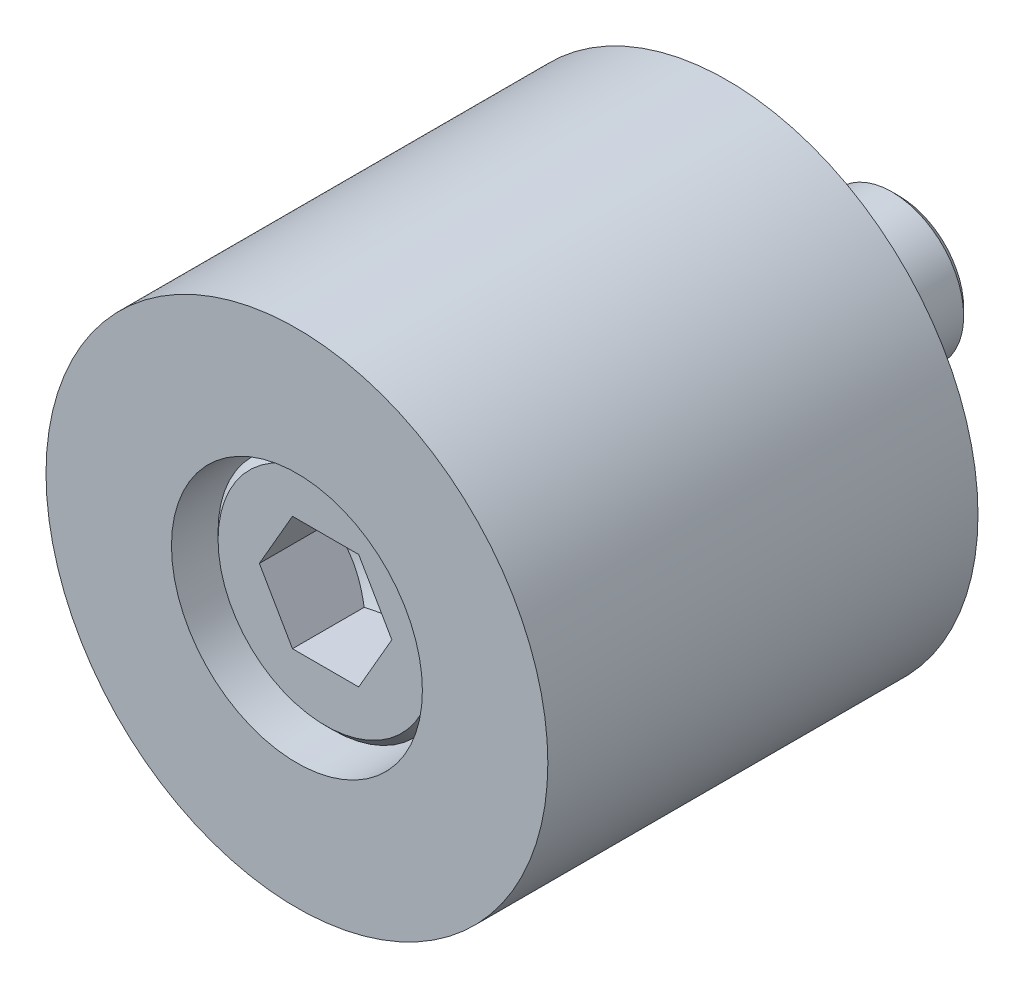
ISO-10303-21;
HEADER;
FILE_DESCRIPTION(('STEP AP214'),'2;1');
FILE_NAME('part.step','',(''),(''),'','','');
FILE_SCHEMA(('AUTOMOTIVE_DESIGN { 1 0 10303 214 1 1 1 1 }'));
ENDSEC;
DATA;
#1=APPLICATION_CONTEXT('core data for automotive mechanical design processes');
#2=APPLICATION_PROTOCOL_DEFINITION('international standard','automotive_design',2000,#1);
#3=PRODUCT_CONTEXT('',#1,'mechanical');
#4=PRODUCT('Part','Part','',(#3));
#5=PRODUCT_RELATED_PRODUCT_CATEGORY('part','',(#4));
#6=PRODUCT_DEFINITION_FORMATION('','',#4);
#7=PRODUCT_DEFINITION_CONTEXT('part definition',#1,'design');
#8=PRODUCT_DEFINITION('design','',#6,#7);
#9=PRODUCT_DEFINITION_SHAPE('','',#8);
#10=(LENGTH_UNIT() NAMED_UNIT(*) SI_UNIT(.MILLI.,.METRE.));
#11=(NAMED_UNIT(*) PLANE_ANGLE_UNIT() SI_UNIT($,.RADIAN.));
#12=(NAMED_UNIT(*) SI_UNIT($,.STERADIAN.) SOLID_ANGLE_UNIT());
#13=UNCERTAINTY_MEASURE_WITH_UNIT(LENGTH_MEASURE(1.E-05),#10,'distance_accuracy_value','');
#14=(GEOMETRIC_REPRESENTATION_CONTEXT(3) GLOBAL_UNCERTAINTY_ASSIGNED_CONTEXT((#13)) GLOBAL_UNIT_ASSIGNED_CONTEXT((#10,
#11,#12)) REPRESENTATION_CONTEXT('',''));
#15=CARTESIAN_POINT('',(0.,0.,0.));
#16=DIRECTION('',(0.,0.,1.));
#17=DIRECTION('',(1.,0.,0.));
#18=AXIS2_PLACEMENT_3D('',#15,#16,#17);
#19=CARTESIAN_POINT('',(0.,0.,15.));
#20=DIRECTION('',(0.,0.,-1.));
#21=DIRECTION('',(1.,0.,0.));
#22=AXIS2_PLACEMENT_3D('',#19,#20,#21);
#23=CYLINDRICAL_SURFACE('',#22,5.25);
#24=CARTESIAN_POINT('',(0.,0.,18.));
#25=DIRECTION('',(0.,0.,1.));
#26=DIRECTION('',(-1.,0.,0.));
#27=AXIS2_PLACEMENT_3D('',#24,#25,#26);
#28=CIRCLE('',#27,5.25);
#29=CARTESIAN_POINT('',(-5.25,0.,18.));
#30=VERTEX_POINT('',#29);
#31=CARTESIAN_POINT('',(5.25,0.,18.));
#32=VERTEX_POINT('',#31);
#33=EDGE_CURVE('P0_E36',#30,#32,#28,.T.);
#34=ORIENTED_EDGE('',*,*,#33,.T.);
#35=CARTESIAN_POINT('',(5.25,0.,17.9999986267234));
#36=CARTESIAN_POINT('',(5.25,0.,-1.84147465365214E-06));
#37=B_SPLINE_CURVE_WITH_KNOTS('',1,(#35,#36),.UNSPECIFIED.,.F.,.F.,(2,2),(0.0833333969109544,
0.916666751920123),.UNSPECIFIED.);
#38=CARTESIAN_POINT('',(5.25,0.,0.));
#39=VERTEX_POINT('',#38);
#40=EDGE_CURVE('P0_E25',#32,#39,#37,.T.);
#41=ORIENTED_EDGE('',*,*,#40,.T.);
#42=CARTESIAN_POINT('',(0.,0.,0.));
#43=DIRECTION('',(0.,0.,1.));
#44=DIRECTION('',(1.,0.,0.));
#45=AXIS2_PLACEMENT_3D('',#42,#43,#44);
#46=CIRCLE('',#45,5.25000000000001);
#47=EDGE_CURVE('P0_E11',#39,#39,#46,.T.);
#48=ORIENTED_EDGE('',*,*,#47,.F.);
#49=ORIENTED_EDGE('',*,*,#40,.F.);
#50=CARTESIAN_POINT('',(0.,0.,18.));
#51=DIRECTION('',(0.,0.,1.));
#52=DIRECTION('',(-1.,0.,0.));
#53=AXIS2_PLACEMENT_3D('',#50,#51,#52);
#54=CIRCLE('',#53,5.25);
#55=EDGE_CURVE('P0_E51',#32,#30,#54,.T.);
#56=ORIENTED_EDGE('',*,*,#55,.T.);
#57=EDGE_LOOP('',(#34,#41,#48,#49,#56));
#58=FACE_BOUND('',#57,.T.);
#59=ADVANCED_FACE('P0_F16',(#58),#23,.F.);
#60=CARTESIAN_POINT('',(0.,0.,24.));
#61=DIRECTION('',(0.,0.,-1.));
#62=DIRECTION('',(1.,0.,0.));
#63=AXIS2_PLACEMENT_3D('',#60,#61,#62);
#64=CYLINDRICAL_SURFACE('',#63,8.75);
#65=CARTESIAN_POINT('',(0.,0.,30.));
#66=DIRECTION('',(0.,0.,-1.));
#67=DIRECTION('',(1.,0.,0.));
#68=AXIS2_PLACEMENT_3D('',#65,#66,#67);
#69=CIRCLE('',#68,8.75);
#70=CARTESIAN_POINT('',(8.75,0.,30.));
#71=VERTEX_POINT('',#70);
#72=EDGE_CURVE('P0_E53',#71,#71,#69,.T.);
#73=ORIENTED_EDGE('',*,*,#72,.F.);
#74=CARTESIAN_POINT('',(8.75,0.,29.9999990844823));
#75=CARTESIAN_POINT('',(8.75,0.,17.9999987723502));
#76=B_SPLINE_CURVE_WITH_KNOTS('',1,(#74,#75),.UNSPECIFIED.,.F.,.F.,(2,2),(0.0833333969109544,
0.916666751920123),.UNSPECIFIED.);
#77=CARTESIAN_POINT('',(8.75,0.,18.));
#78=VERTEX_POINT('',#77);
#79=EDGE_CURVE('P0_E91',#71,#78,#76,.T.);
#80=ORIENTED_EDGE('',*,*,#79,.T.);
#81=CARTESIAN_POINT('',(0.,0.,18.));
#82=DIRECTION('',(0.,0.,-1.));
#83=DIRECTION('',(1.,0.,0.));
#84=AXIS2_PLACEMENT_3D('',#81,#82,#83);
#85=CIRCLE('',#84,8.75);
#86=EDGE_CURVE('P0_E94',#78,#78,#85,.T.);
#87=ORIENTED_EDGE('',*,*,#86,.T.);
#88=ORIENTED_EDGE('',*,*,#79,.F.);
#89=EDGE_LOOP('',(#73,#80,#87,#88));
#90=FACE_BOUND('',#89,.T.);
#91=ADVANCED_FACE('P0_F111',(#90),#64,.F.);
#92=CARTESIAN_POINT('',(-20.125,18.1865334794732,18.));
#93=DIRECTION('',(0.,0.,-1.));
#94=DIRECTION('',(1.,0.,0.));
#95=AXIS2_PLACEMENT_3D('',#92,#93,#94);
#96=PLANE('',#95);
#97=ORIENTED_EDGE('',*,*,#86,.F.);
#98=EDGE_LOOP('',(#97));
#99=FACE_BOUND('',#98,.T.);
#100=ORIENTED_EDGE('',*,*,#55,.F.);
#101=ORIENTED_EDGE('',*,*,#33,.F.);
#102=EDGE_LOOP('',(#100,#101));
#103=FACE_BOUND('',#102,.T.);
#104=ADVANCED_FACE('P0_F55',(#99,#103),#96,.F.);
#105=CARTESIAN_POINT('',(0.,0.,15.));
#106=DIRECTION('',(0.,0.,1.));
#107=DIRECTION('',(1.,0.,0.));
#108=AXIS2_PLACEMENT_3D('',#105,#106,#107);
#109=CYLINDRICAL_SURFACE('',#108,17.5);
#110=CARTESIAN_POINT('',(0.,0.,0.));
#111=DIRECTION('',(0.,0.,-1.));
#112=DIRECTION('',(1.,0.,0.));
#113=AXIS2_PLACEMENT_3D('',#110,#111,#112);
#114=CIRCLE('',#113,17.5);
#115=CARTESIAN_POINT('',(17.5,0.,0.));
#116=VERTEX_POINT('',#115);
#117=EDGE_CURVE('P0_E85',#116,#116,#114,.T.);
#118=ORIENTED_EDGE('',*,*,#117,.F.);
#119=CARTESIAN_POINT('',(17.5,0.,-1.1444331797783E-06));
#120=CARTESIAN_POINT('',(17.5,0.,29.9999996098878));
#121=B_SPLINE_CURVE_WITH_KNOTS('',1,(#119,#120),.UNSPECIFIED.,.F.,.F.,(2,2),(0.0833333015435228,
0.916666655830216),.UNSPECIFIED.);
#122=CARTESIAN_POINT('',(17.5,0.,30.));
#123=VERTEX_POINT('',#122);
#124=EDGE_CURVE('P0_E57',#116,#123,#121,.T.);
#125=ORIENTED_EDGE('',*,*,#124,.T.);
#126=CARTESIAN_POINT('',(0.,0.,30.));
#127=DIRECTION('',(0.,0.,1.));
#128=DIRECTION('',(1.,0.,0.));
#129=AXIS2_PLACEMENT_3D('',#126,#127,#128);
#130=CIRCLE('',#129,17.5);
#131=EDGE_CURVE('P0_E82',#123,#123,#130,.T.);
#132=ORIENTED_EDGE('',*,*,#131,.F.);
#133=ORIENTED_EDGE('',*,*,#124,.F.);
#134=EDGE_LOOP('',(#118,#125,#132,#133));
#135=FACE_BOUND('',#134,.T.);
#136=ADVANCED_FACE('P0_F130',(#135),#109,.T.);
#137=CARTESIAN_POINT('',(22.75,-36.3730669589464,0.));
#138=DIRECTION('',(0.,0.,-1.));
#139=DIRECTION('',(-1.,0.,0.));
#140=AXIS2_PLACEMENT_3D('',#137,#138,#139);
#141=PLANE('',#140);
#142=ORIENTED_EDGE('',*,*,#117,.T.);
#143=EDGE_LOOP('',(#142));
#144=FACE_BOUND('',#143,.T.);
#145=ORIENTED_EDGE('',*,*,#47,.T.);
#146=EDGE_LOOP('',(#145));
#147=FACE_BOUND('',#146,.T.);
#148=ADVANCED_FACE('P0_F132',(#144,#147),#141,.T.);
#149=CARTESIAN_POINT('',(-40.25,-36.3730669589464,30.));
#150=DIRECTION('',(0.,0.,1.));
#151=DIRECTION('',(1.,0.,0.));
#152=AXIS2_PLACEMENT_3D('',#149,#150,#151);
#153=PLANE('',#152);
#154=ORIENTED_EDGE('',*,*,#131,.T.);
#155=EDGE_LOOP('',(#154));
#156=FACE_BOUND('',#155,.T.);
#157=ORIENTED_EDGE('',*,*,#72,.T.);
#158=EDGE_LOOP('',(#157));
#159=FACE_BOUND('',#158,.T.);
#160=ADVANCED_FACE('P0_F108',(#156,#159),#153,.T.);
#161=CLOSED_SHELL('',(#59,#91,#104,#136,#148,#160));
#162=MANIFOLD_SOLID_BREP('P0_B1',#161);
#163=CARTESIAN_POINT('',(0.,0.,-9.42893218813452));
#164=DIRECTION('',(0.,0.,1.));
#165=DIRECTION('',(-1.,0.,0.));
#166=AXIS2_PLACEMENT_3D('',#163,#164,#165);
#167=CONICAL_SURFACE('',#166,7.07106781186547,0.785398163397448);
#168=CARTESIAN_POINT('',(0.,0.,-12.));
#169=DIRECTION('',(0.,0.,1.));
#170=DIRECTION('',(1.,0.,0.));
#171=AXIS2_PLACEMENT_3D('',#168,#169,#170);
#172=CIRCLE('',#171,4.5);
#173=CARTESIAN_POINT('',(4.5,0.,-12.));
#174=VERTEX_POINT('',#173);
#175=CARTESIAN_POINT('',(-4.5,0.,-12.));
#176=VERTEX_POINT('',#175);
#177=EDGE_CURVE('P1_E37',#174,#176,#172,.T.);
#178=ORIENTED_EDGE('',*,*,#177,.T.);
#179=CARTESIAN_POINT('',(-4.50000215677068,0.,-11.9999978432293));
#180=CARTESIAN_POINT('',(-5.00000242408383,0.,-11.4999975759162));
#181=B_SPLINE_CURVE_WITH_KNOTS('',1,(#179,#180),.UNSPECIFIED.,.F.,.F.,(2,2),(0.636396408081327,
0.70710712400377),.UNSPECIFIED.);
#182=CARTESIAN_POINT('',(-5.,0.,-11.5));
#183=VERTEX_POINT('',#182);
#184=EDGE_CURVE('P1_E24',#176,#183,#181,.T.);
#185=ORIENTED_EDGE('',*,*,#184,.T.);
#186=CARTESIAN_POINT('',(0.,0.,-11.5));
#187=DIRECTION('',(0.,0.,-1.));
#188=DIRECTION('',(1.,0.,0.));
#189=AXIS2_PLACEMENT_3D('',#186,#187,#188);
#190=CIRCLE('',#189,5.);
#191=CARTESIAN_POINT('',(5.,0.,-11.5));
#192=VERTEX_POINT('',#191);
#193=EDGE_CURVE('P1_E173',#183,#192,#190,.T.);
#194=ORIENTED_EDGE('',*,*,#193,.T.);
#195=CARTESIAN_POINT('',(0.,0.,-11.5));
#196=DIRECTION('',(0.,0.,-1.));
#197=DIRECTION('',(1.,0.,0.));
#198=AXIS2_PLACEMENT_3D('',#195,#196,#197);
#199=CIRCLE('',#198,5.);
#200=EDGE_CURVE('P1_E10',#192,#183,#199,.T.);
#201=ORIENTED_EDGE('',*,*,#200,.T.);
#202=ORIENTED_EDGE('',*,*,#184,.F.);
#203=CARTESIAN_POINT('',(0.,0.,-12.));
#204=DIRECTION('',(0.,0.,1.));
#205=DIRECTION('',(1.,0.,0.));
#206=AXIS2_PLACEMENT_3D('',#203,#204,#205);
#207=CIRCLE('',#206,4.5);
#208=EDGE_CURVE('P1_E146',#176,#174,#207,.T.);
#209=ORIENTED_EDGE('',*,*,#208,.T.);
#210=EDGE_LOOP('',(#178,#185,#194,#201,#202,#209));
#211=FACE_BOUND('',#210,.T.);
#212=ADVANCED_FACE('P1_F15',(#211),#167,.T.);
#213=CARTESIAN_POINT('',(0.,0.,3.));
#214=DIRECTION('',(0.,0.,-1.));
#215=DIRECTION('',(1.,0.,0.));
#216=AXIS2_PLACEMENT_3D('',#213,#214,#215);
#217=CYLINDRICAL_SURFACE('',#216,5.);
#218=CARTESIAN_POINT('',(0.,0.,18.));
#219=DIRECTION('',(0.,0.,1.));
#220=DIRECTION('',(1.,0.,0.));
#221=AXIS2_PLACEMENT_3D('',#218,#219,#220);
#222=CIRCLE('',#221,5.);
#223=CARTESIAN_POINT('',(5.,0.,18.));
#224=VERTEX_POINT('',#223);
#225=EDGE_CURVE('P1_E154',#224,#224,#222,.T.);
#226=ORIENTED_EDGE('',*,*,#225,.F.);
#227=CARTESIAN_POINT('',(5.,0.,18.0000011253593));
#228=CARTESIAN_POINT('',(5.,0.,-11.4999996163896));
#229=B_SPLINE_CURVE_WITH_KNOTS('',1,(#227,#228),.UNSPECIFIED.,.F.,.F.,(2,2),(0.0833333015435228,
0.916666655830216),.UNSPECIFIED.);
#230=EDGE_CURVE('P1_E127',#224,#192,#229,.T.);
#231=ORIENTED_EDGE('',*,*,#230,.T.);
#232=ORIENTED_EDGE('',*,*,#193,.F.);
#233=ORIENTED_EDGE('',*,*,#200,.F.);
#234=ORIENTED_EDGE('',*,*,#230,.F.);
#235=EDGE_LOOP('',(#226,#231,#232,#233,#234));
#236=FACE_BOUND('',#235,.T.);
#237=ADVANCED_FACE('P1_F337',(#236),#217,.T.);
#238=CARTESIAN_POINT('',(-10.35,9.35307436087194,-12.));
#239=DIRECTION('',(0.,0.,-1.));
#240=DIRECTION('',(1.,0.,0.));
#241=AXIS2_PLACEMENT_3D('',#238,#239,#240);
#242=PLANE('',#241);
#243=ORIENTED_EDGE('',*,*,#208,.F.);
#244=ORIENTED_EDGE('',*,*,#177,.F.);
#245=EDGE_LOOP('',(#243,#244));
#246=FACE_BOUND('',#245,.T.);
#247=ADVANCED_FACE('P1_F340',(#246),#242,.T.);
#248=CARTESIAN_POINT('',(0.,0.,24.1862915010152));
#249=DIRECTION('',(0.,0.,-1.));
#250=DIRECTION('',(-1.,0.,0.));
#251=AXIS2_PLACEMENT_3D('',#248,#249,#250);
#252=CONICAL_SURFACE('',#251,11.3137084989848,0.785398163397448);
#253=CARTESIAN_POINT('',(0.,0.,28.));
#254=DIRECTION('',(0.,0.,-1.));
#255=DIRECTION('',(1.,0.,0.));
#256=AXIS2_PLACEMENT_3D('',#253,#254,#255);
#257=CIRCLE('',#256,7.5);
#258=CARTESIAN_POINT('',(7.5,0.,28.));
#259=VERTEX_POINT('',#258);
#260=CARTESIAN_POINT('',(-7.5,0.,28.));
#261=VERTEX_POINT('',#260);
#262=EDGE_CURVE('P1_E102',#259,#261,#257,.T.);
#263=ORIENTED_EDGE('',*,*,#262,.T.);
#264=CARTESIAN_POINT('',(-7.49999945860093,0.,28.0000005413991));
#265=CARTESIAN_POINT('',(-7.99999885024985,0.,27.5000011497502));
#266=B_SPLINE_CURVE_WITH_KNOTS('',1,(#264,#265),.UNSPECIFIED.,.F.,.F.,(2,2),(0.662912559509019,
0.707106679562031),.UNSPECIFIED.);
#267=CARTESIAN_POINT('',(-8.,0.,27.5));
#268=VERTEX_POINT('',#267);
#269=EDGE_CURVE('P1_E107',#261,#268,#266,.T.);
#270=ORIENTED_EDGE('',*,*,#269,.T.);
#271=CARTESIAN_POINT('',(0.,0.,27.5));
#272=DIRECTION('',(0.,0.,1.));
#273=DIRECTION('',(1.,0.,0.));
#274=AXIS2_PLACEMENT_3D('',#271,#272,#273);
#275=CIRCLE('',#274,8.);
#276=CARTESIAN_POINT('',(8.,0.,27.5));
#277=VERTEX_POINT('',#276);
#278=EDGE_CURVE('P1_E117',#268,#277,#275,.T.);
#279=ORIENTED_EDGE('',*,*,#278,.T.);
#280=CARTESIAN_POINT('',(0.,0.,27.5));
#281=DIRECTION('',(0.,0.,1.));
#282=DIRECTION('',(1.,0.,0.));
#283=AXIS2_PLACEMENT_3D('',#280,#281,#282);
#284=CIRCLE('',#283,8.);
#285=EDGE_CURVE('P1_E119',#277,#268,#284,.T.);
#286=ORIENTED_EDGE('',*,*,#285,.T.);
#287=ORIENTED_EDGE('',*,*,#269,.F.);
#288=CARTESIAN_POINT('',(0.,0.,28.));
#289=DIRECTION('',(0.,0.,-1.));
#290=DIRECTION('',(1.,0.,0.));
#291=AXIS2_PLACEMENT_3D('',#288,#289,#290);
#292=CIRCLE('',#291,7.5);
#293=EDGE_CURVE('P1_E109',#261,#259,#292,.T.);
#294=ORIENTED_EDGE('',*,*,#293,.T.);
#295=EDGE_LOOP('',(#263,#270,#279,#286,#287,#294));
#296=FACE_BOUND('',#295,.T.);
#297=ADVANCED_FACE('P1_F104',(#296),#252,.T.);
#298=CARTESIAN_POINT('',(0.,0.,23.));
#299=DIRECTION('',(0.,0.,1.));
#300=DIRECTION('',(1.,0.,0.));
#301=AXIS2_PLACEMENT_3D('',#298,#299,#300);
#302=CYLINDRICAL_SURFACE('',#301,8.);
#303=CARTESIAN_POINT('',(0.,0.,18.));
#304=DIRECTION('',(0.,0.,-1.));
#305=DIRECTION('',(1.,0.,0.));
#306=AXIS2_PLACEMENT_3D('',#303,#304,#305);
#307=CIRCLE('',#306,8.);
#308=CARTESIAN_POINT('',(8.,0.,18.));
#309=VERTEX_POINT('',#308);
#310=EDGE_CURVE('P1_E112',#309,#309,#307,.T.);
#311=ORIENTED_EDGE('',*,*,#310,.F.);
#312=CARTESIAN_POINT('',(8.,0.,17.9999985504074));
#313=CARTESIAN_POINT('',(8.,0.,27.4999987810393));
#314=B_SPLINE_CURVE_WITH_KNOTS('',1,(#312,#313),.UNSPECIFIED.,.F.,.F.,(2,2),(0.0833332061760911,
0.916666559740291),.UNSPECIFIED.);
#315=EDGE_CURVE('P1_E317',#309,#277,#314,.T.);
#316=ORIENTED_EDGE('',*,*,#315,.T.);
#317=ORIENTED_EDGE('',*,*,#278,.F.);
#318=ORIENTED_EDGE('',*,*,#285,.F.);
#319=ORIENTED_EDGE('',*,*,#315,.F.);
#320=EDGE_LOOP('',(#311,#316,#317,#318,#319));
#321=FACE_BOUND('',#320,.T.);
#322=ADVANCED_FACE('P1_F348',(#321),#302,.T.);
#323=CARTESIAN_POINT('',(-17.25,-15.5884572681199,28.));
#324=DIRECTION('',(0.,0.,1.));
#325=DIRECTION('',(1.,0.,0.));
#326=AXIS2_PLACEMENT_3D('',#323,#324,#325);
#327=PLANE('',#326);
#328=ORIENTED_EDGE('',*,*,#293,.F.);
#329=ORIENTED_EDGE('',*,*,#262,.F.);
#330=EDGE_LOOP('',(#328,#329));
#331=FACE_BOUND('',#330,.T.);
#332=DIRECTION('',(-0.500000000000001,0.866025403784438,0.));
#333=VECTOR('',#332,1.);
#334=CARTESIAN_POINT('',(-2.3094010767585,-4.,28.));
#335=LINE('',#334,#333);
#336=CARTESIAN_POINT('',(-2.3094010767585,-4.,28.));
#337=VERTEX_POINT('',#336);
#338=CARTESIAN_POINT('',(-4.61880215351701,0.,28.));
#339=VERTEX_POINT('',#338);
#340=EDGE_CURVE('P1_E312',#337,#339,#335,.T.);
#341=ORIENTED_EDGE('',*,*,#340,.T.);
#342=DIRECTION('',(0.5,0.866025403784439,0.));
#343=VECTOR('',#342,1.);
#344=CARTESIAN_POINT('',(-4.61880215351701,0.,28.));
#345=LINE('',#344,#343);
#346=CARTESIAN_POINT('',(-2.3094010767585,4.,28.));
#347=VERTEX_POINT('',#346);
#348=EDGE_CURVE('P1_E306',#339,#347,#345,.T.);
#349=ORIENTED_EDGE('',*,*,#348,.T.);
#350=DIRECTION('',(1.,0.,0.));
#351=VECTOR('',#350,1.);
#352=CARTESIAN_POINT('',(-2.3094010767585,4.,28.));
#353=LINE('',#352,#351);
#354=CARTESIAN_POINT('',(2.3094010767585,4.,28.));
#355=VERTEX_POINT('',#354);
#356=EDGE_CURVE('P1_E300',#347,#355,#353,.T.);
#357=ORIENTED_EDGE('',*,*,#356,.T.);
#358=DIRECTION('',(0.500000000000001,-0.866025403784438,0.));
#359=VECTOR('',#358,1.);
#360=CARTESIAN_POINT('',(2.3094010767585,4.,28.));
#361=LINE('',#360,#359);
#362=CARTESIAN_POINT('',(4.61880215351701,0.,28.));
#363=VERTEX_POINT('',#362);
#364=EDGE_CURVE('P1_E294',#355,#363,#361,.T.);
#365=ORIENTED_EDGE('',*,*,#364,.T.);
#366=DIRECTION('',(-0.499999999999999,-0.866025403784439,0.));
#367=VECTOR('',#366,1.);
#368=CARTESIAN_POINT('',(4.61880215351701,0.,28.));
#369=LINE('',#368,#367);
#370=CARTESIAN_POINT('',(2.30940107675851,-4.,28.));
#371=VERTEX_POINT('',#370);
#372=EDGE_CURVE('P1_E288',#363,#371,#369,.T.);
#373=ORIENTED_EDGE('',*,*,#372,.T.);
#374=DIRECTION('',(-1.,0.,0.));
#375=VECTOR('',#374,1.);
#376=CARTESIAN_POINT('',(2.30940107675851,-4.,28.));
#377=LINE('',#376,#375);
#378=EDGE_CURVE('P1_E277',#371,#337,#377,.T.);
#379=ORIENTED_EDGE('',*,*,#378,.T.);
#380=EDGE_LOOP('',(#341,#349,#357,#365,#373,#379));
#381=FACE_BOUND('',#380,.T.);
#382=ADVANCED_FACE('P1_F114',(#331,#381),#327,.T.);
#383=CARTESIAN_POINT('',(0.,0.,23.8960627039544));
#384=DIRECTION('',(0.,0.,1.));
#385=DIRECTION('',(-1.,0.,0.));
#386=AXIS2_PLACEMENT_3D('',#383,#384,#385);
#387=CONICAL_SURFACE('',#386,6.11010092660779,1.02974425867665);
#388=CARTESIAN_POINT('',(0.,0.,20.2347436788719));
#389=DIRECTION('',(0.,0.,-1.));
#390=DIRECTION('',(-1.,0.,0.));
#391=AXIS2_PLACEMENT_3D('',#388,#389,#390);
#392=CIRCLE('',#391,0.0166427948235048);
#393=CARTESIAN_POINT('',(-0.0166427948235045,0.,20.2347436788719));
#394=VERTEX_POINT('',#393);
#395=EDGE_CURVE('P1_E216',#394,#394,#392,.T.);
#396=ORIENTED_EDGE('',*,*,#395,.T.);
#397=CARTESIAN_POINT('',(-0.0166453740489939,0.,20.234745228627));
#398=CARTESIAN_POINT('',(-4.61880474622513,0.,23.0000015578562));
#399=B_SPLINE_CURVE_WITH_KNOTS('',1,(#397,#398),.UNSPECIFIED.,.F.,.F.,(2,2),
(0.00272423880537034,0.755929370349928),.UNSPECIFIED.);
#400=CARTESIAN_POINT('',(-4.61880215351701,0.,23.));
#401=VERTEX_POINT('',#400);
#402=EDGE_CURVE('P1_E221',#394,#401,#399,.T.);
#403=ORIENTED_EDGE('',*,*,#402,.T.);
#404=CARTESIAN_POINT('',(-4.618802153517,0.,23.));
#405=CARTESIAN_POINT('',(-3.46410161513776,-2.,22.306185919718));
#406=CARTESIAN_POINT('',(-2.30940107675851,-3.99999999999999,23.));
#407=(BOUNDED_CURVE() B_SPLINE_CURVE(2,(#404,#405,#406),.UNSPECIFIED.,.F.,
.F.) B_SPLINE_CURVE_WITH_KNOTS((3,3),(0.,4.67828125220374),
.UNSPECIFIED.) CURVE() GEOMETRIC_REPRESENTATION_ITEM() RATIONAL_B_SPLINE_CURVE((1.,
1.15470053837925,1.)) REPRESENTATION_ITEM(''));
#408=CARTESIAN_POINT('',(-2.3094010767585,-4.,23.));
#409=VERTEX_POINT('',#408);
#410=EDGE_CURVE('P1_E227',#401,#409,#407,.T.);
#411=ORIENTED_EDGE('',*,*,#410,.T.);
#412=CARTESIAN_POINT('',(-2.30940107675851,-4.,23.));
#413=CARTESIAN_POINT('',(0.,-4.,22.306185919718));
#414=CARTESIAN_POINT('',(2.3094010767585,-4.,23.));
#415=(BOUNDED_CURVE() B_SPLINE_CURVE(2,(#412,#413,#414),.UNSPECIFIED.,.F.,
.F.) B_SPLINE_CURVE_WITH_KNOTS((3,3),(0.,4.67828125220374),
.UNSPECIFIED.) CURVE() GEOMETRIC_REPRESENTATION_ITEM() RATIONAL_B_SPLINE_CURVE((1.,
1.15470053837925,1.)) REPRESENTATION_ITEM(''));
#416=CARTESIAN_POINT('',(2.30940107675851,-4.,23.));
#417=VERTEX_POINT('',#416);
#418=EDGE_CURVE('P1_E224',#409,#417,#415,.T.);
#419=ORIENTED_EDGE('',*,*,#418,.T.);
#420=CARTESIAN_POINT('',(2.3094010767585,-4.,23.));
#421=CARTESIAN_POINT('',(3.46410161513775,-2.,22.306185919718));
#422=CARTESIAN_POINT('',(4.618802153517,0.,23.));
#423=(BOUNDED_CURVE() B_SPLINE_CURVE(2,(#420,#421,#422),.UNSPECIFIED.,.F.,
.F.) B_SPLINE_CURVE_WITH_KNOTS((3,3),(0.,4.67828125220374),
.UNSPECIFIED.) CURVE() GEOMETRIC_REPRESENTATION_ITEM() RATIONAL_B_SPLINE_CURVE((1.,
1.15470053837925,1.)) REPRESENTATION_ITEM(''));
#424=CARTESIAN_POINT('',(4.61880215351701,0.,23.));
#425=VERTEX_POINT('',#424);
#426=EDGE_CURVE('P1_E267',#417,#425,#423,.T.);
#427=ORIENTED_EDGE('',*,*,#426,.T.);
#428=CARTESIAN_POINT('',(4.618802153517,0.,23.));
#429=CARTESIAN_POINT('',(3.46410161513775,2.,22.306185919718));
#430=CARTESIAN_POINT('',(2.3094010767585,4.,23.));
#431=(BOUNDED_CURVE() B_SPLINE_CURVE(2,(#428,#429,#430),.UNSPECIFIED.,.F.,
.F.) B_SPLINE_CURVE_WITH_KNOTS((3,3),(0.,4.67828125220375),
.UNSPECIFIED.) CURVE() GEOMETRIC_REPRESENTATION_ITEM() RATIONAL_B_SPLINE_CURVE((1.,
1.15470053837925,1.)) REPRESENTATION_ITEM(''));
#432=CARTESIAN_POINT('',(2.3094010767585,4.,23.));
#433=VERTEX_POINT('',#432);
#434=EDGE_CURVE('P1_E257',#425,#433,#431,.T.);
#435=ORIENTED_EDGE('',*,*,#434,.T.);
#436=CARTESIAN_POINT('',(2.3094010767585,4.,23.));
#437=CARTESIAN_POINT('',(0.,4.,22.306185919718));
#438=CARTESIAN_POINT('',(-2.3094010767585,4.,23.));
#439=(BOUNDED_CURVE() B_SPLINE_CURVE(2,(#436,#437,#438),.UNSPECIFIED.,.F.,
.F.) B_SPLINE_CURVE_WITH_KNOTS((3,3),(0.,4.67828125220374),
.UNSPECIFIED.) CURVE() GEOMETRIC_REPRESENTATION_ITEM() RATIONAL_B_SPLINE_CURVE((1.,
1.15470053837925,1.)) REPRESENTATION_ITEM(''));
#440=CARTESIAN_POINT('',(-2.3094010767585,4.,23.));
#441=VERTEX_POINT('',#440);
#442=EDGE_CURVE('P1_E247',#433,#441,#439,.T.);
#443=ORIENTED_EDGE('',*,*,#442,.T.);
#444=CARTESIAN_POINT('',(-2.3094010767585,4.,23.));
#445=CARTESIAN_POINT('',(-3.46410161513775,2.,22.306185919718));
#446=CARTESIAN_POINT('',(-4.618802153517,0.,23.));
#447=(BOUNDED_CURVE() B_SPLINE_CURVE(2,(#444,#445,#446),.UNSPECIFIED.,.F.,
.F.) B_SPLINE_CURVE_WITH_KNOTS((3,3),(0.,4.67828125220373),
.UNSPECIFIED.) CURVE() GEOMETRIC_REPRESENTATION_ITEM() RATIONAL_B_SPLINE_CURVE((1.,
1.15470053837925,1.)) REPRESENTATION_ITEM(''));
#448=EDGE_CURVE('P1_E237',#441,#401,#447,.T.);
#449=ORIENTED_EDGE('',*,*,#448,.T.);
#450=ORIENTED_EDGE('',*,*,#402,.F.);
#451=EDGE_LOOP('',(#396,#403,#411,#419,#427,#435,#443,#449,#450));
#452=FACE_BOUND('',#451,.T.);
#453=ADVANCED_FACE('P1_F390',(#452),#387,.F.);
#454=CARTESIAN_POINT('',(0.0382784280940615,-0.0345913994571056,20.2347436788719));
#455=DIRECTION('',(0.,0.,-1.));
#456=DIRECTION('',(-1.,0.,0.));
#457=AXIS2_PLACEMENT_3D('',#454,#455,#456);
#458=PLANE('',#457);
#459=ORIENTED_EDGE('',*,*,#395,.F.);
#460=EDGE_LOOP('',(#459));
#461=FACE_BOUND('',#460,.T.);
#462=ADVANCED_FACE('P1_F398',(#461),#458,.F.);
#463=CARTESIAN_POINT('',(-2.07846096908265,-4.4,28.5693814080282));
#464=DIRECTION('',(-0.866025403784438,-0.500000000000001,0.));
#465=DIRECTION('',(-0.500000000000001,0.866025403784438,0.));
#466=AXIS2_PLACEMENT_3D('',#463,#464,#465);
#467=PLANE('',#466);
#468=DIRECTION('',(0.,0.,-1.));
#469=VECTOR('',#468,1.);
#470=CARTESIAN_POINT('',(-4.61880215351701,0.,28.));
#471=LINE('',#470,#469);
#472=EDGE_CURVE('P1_E210',#339,#401,#471,.T.);
#473=ORIENTED_EDGE('',*,*,#472,.F.);
#474=ORIENTED_EDGE('',*,*,#340,.F.);
#475=DIRECTION('',(0.,0.,-1.));
#476=VECTOR('',#475,1.);
#477=CARTESIAN_POINT('',(-2.3094010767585,-4.,28.));
#478=LINE('',#477,#476);
#479=EDGE_CURVE('P1_E204',#337,#409,#478,.T.);
#480=ORIENTED_EDGE('',*,*,#479,.T.);
#481=ORIENTED_EDGE('',*,*,#410,.F.);
#482=EDGE_LOOP('',(#473,#474,#480,#481));
#483=FACE_BOUND('',#482,.T.);
#484=ADVANCED_FACE('P1_F407',(#483),#467,.F.);
#485=CARTESIAN_POINT('',(2.77128129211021,-4.,28.5693814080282));
#486=DIRECTION('',(0.,-1.,0.));
#487=DIRECTION('',(-1.,0.,0.));
#488=AXIS2_PLACEMENT_3D('',#485,#486,#487);
#489=PLANE('',#488);
#490=ORIENTED_EDGE('',*,*,#479,.F.);
#491=ORIENTED_EDGE('',*,*,#378,.F.);
#492=DIRECTION('',(0.,0.,-1.));
#493=VECTOR('',#492,1.);
#494=CARTESIAN_POINT('',(2.30940107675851,-4.,28.));
#495=LINE('',#494,#493);
#496=EDGE_CURVE('P1_E198',#371,#417,#495,.T.);
#497=ORIENTED_EDGE('',*,*,#496,.T.);
#498=ORIENTED_EDGE('',*,*,#418,.F.);
#499=EDGE_LOOP('',(#490,#491,#497,#498));
#500=FACE_BOUND('',#499,.T.);
#501=ADVANCED_FACE('P1_F416',(#500),#489,.F.);
#502=CARTESIAN_POINT('',(4.84974226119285,0.400000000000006,28.5693814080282));
#503=DIRECTION('',(0.866025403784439,-0.499999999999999,0.));
#504=DIRECTION('',(-0.499999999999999,-0.866025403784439,0.));
#505=AXIS2_PLACEMENT_3D('',#502,#503,#504);
#506=PLANE('',#505);
#507=ORIENTED_EDGE('',*,*,#496,.F.);
#508=ORIENTED_EDGE('',*,*,#372,.F.);
#509=DIRECTION('',(0.,0.,-1.));
#510=VECTOR('',#509,1.);
#511=CARTESIAN_POINT('',(4.61880215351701,0.,28.));
#512=LINE('',#511,#510);
#513=EDGE_CURVE('P1_E192',#363,#425,#512,.T.);
#514=ORIENTED_EDGE('',*,*,#513,.T.);
#515=ORIENTED_EDGE('',*,*,#426,.F.);
#516=EDGE_LOOP('',(#507,#508,#514,#515));
#517=FACE_BOUND('',#516,.T.);
#518=ADVANCED_FACE('P1_F425',(#517),#506,.F.);
#519=CARTESIAN_POINT('',(2.07846096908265,4.4,28.5693814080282));
#520=DIRECTION('',(0.866025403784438,0.500000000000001,0.));
#521=DIRECTION('',(0.500000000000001,-0.866025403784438,0.));
#522=AXIS2_PLACEMENT_3D('',#519,#520,#521);
#523=PLANE('',#522);
#524=ORIENTED_EDGE('',*,*,#513,.F.);
#525=ORIENTED_EDGE('',*,*,#364,.F.);
#526=DIRECTION('',(0.,0.,-1.));
#527=VECTOR('',#526,1.);
#528=CARTESIAN_POINT('',(2.3094010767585,4.,28.));
#529=LINE('',#528,#527);
#530=EDGE_CURVE('P1_E186',#355,#433,#529,.T.);
#531=ORIENTED_EDGE('',*,*,#530,.T.);
#532=ORIENTED_EDGE('',*,*,#434,.F.);
#533=EDGE_LOOP('',(#524,#525,#531,#532));
#534=FACE_BOUND('',#533,.T.);
#535=ADVANCED_FACE('P1_F434',(#534),#523,.F.);
#536=CARTESIAN_POINT('',(-2.7712812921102,4.,28.5693814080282));
#537=DIRECTION('',(0.,1.,0.));
#538=DIRECTION('',(1.,0.,0.));
#539=AXIS2_PLACEMENT_3D('',#536,#537,#538);
#540=PLANE('',#539);
#541=ORIENTED_EDGE('',*,*,#530,.F.);
#542=ORIENTED_EDGE('',*,*,#356,.F.);
#543=DIRECTION('',(0.,0.,-1.));
#544=VECTOR('',#543,1.);
#545=CARTESIAN_POINT('',(-2.3094010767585,4.,28.));
#546=LINE('',#545,#544);
#547=EDGE_CURVE('P1_E178',#347,#441,#546,.T.);
#548=ORIENTED_EDGE('',*,*,#547,.T.);
#549=ORIENTED_EDGE('',*,*,#442,.F.);
#550=EDGE_LOOP('',(#541,#542,#548,#549));
#551=FACE_BOUND('',#550,.T.);
#552=ADVANCED_FACE('P1_F443',(#551),#540,.F.);
#553=CARTESIAN_POINT('',(-4.84974226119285,-0.400000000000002,28.5693814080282));
#554=DIRECTION('',(-0.866025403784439,0.5,0.));
#555=DIRECTION('',(0.5,0.866025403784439,0.));
#556=AXIS2_PLACEMENT_3D('',#553,#554,#555);
#557=PLANE('',#556);
#558=ORIENTED_EDGE('',*,*,#547,.F.);
#559=ORIENTED_EDGE('',*,*,#348,.F.);
#560=ORIENTED_EDGE('',*,*,#472,.T.);
#561=ORIENTED_EDGE('',*,*,#448,.F.);
#562=EDGE_LOOP('',(#558,#559,#560,#561));
#563=FACE_BOUND('',#562,.T.);
#564=ADVANCED_FACE('P1_F452',(#563),#557,.F.);
#565=CARTESIAN_POINT('',(10.4,-16.6276877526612,18.));
#566=DIRECTION('',(0.,0.,-1.));
#567=DIRECTION('',(-1.,0.,0.));
#568=AXIS2_PLACEMENT_3D('',#565,#566,#567);
#569=PLANE('',#568);
#570=ORIENTED_EDGE('',*,*,#310,.T.);
#571=EDGE_LOOP('',(#570));
#572=FACE_BOUND('',#571,.T.);
#573=ORIENTED_EDGE('',*,*,#225,.T.);
#574=EDGE_LOOP('',(#573));
#575=FACE_BOUND('',#574,.T.);
#576=ADVANCED_FACE('P1_F336',(#572,#575),#569,.T.);
#577=CLOSED_SHELL('',(#212,#237,#247,#297,#322,#382,#453,#462,#484,#501,#518,#535,#552,#564,#576));
#578=MANIFOLD_SOLID_BREP('P1_B1',#577);
#579=ADVANCED_BREP_SHAPE_REPRESENTATION('',(#18,#162,#578),#14);
#580=SHAPE_DEFINITION_REPRESENTATION(#9,#579);
ENDSEC;
END-ISO-10303-21;
